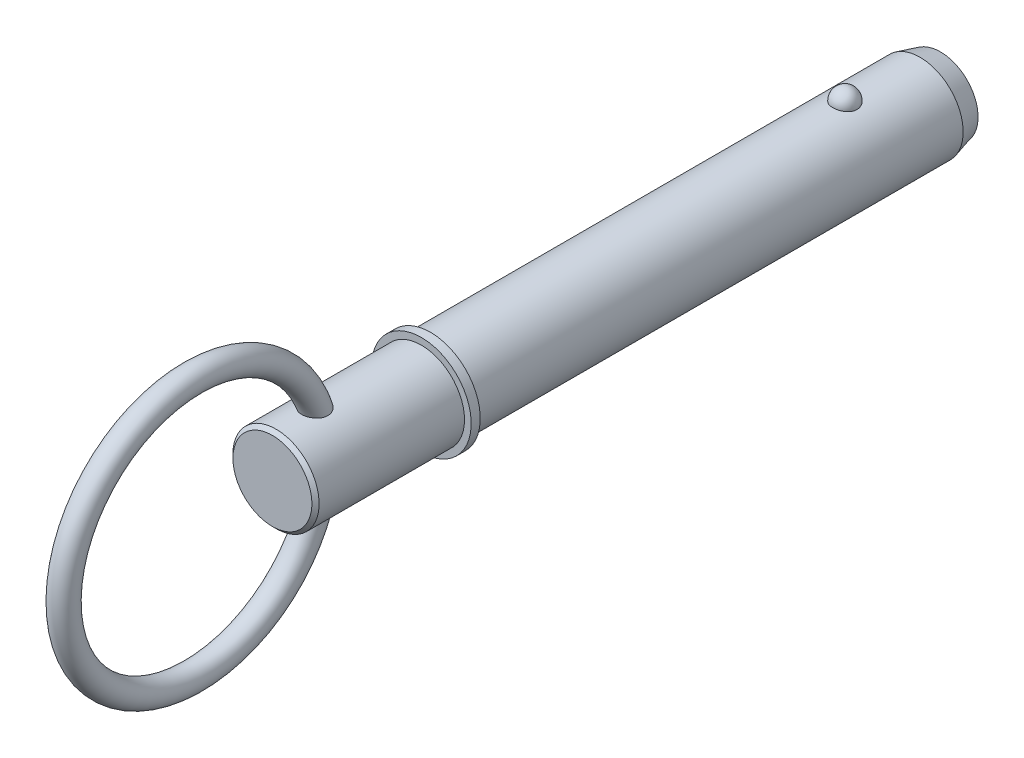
from build123d import *

# Parameters (mm, degrees)
SKETCH2_R           = 9.525
BOSS_EXTRUDE1_DEPTH = 88.9
BOSS_EXTRUDE2_START = 23.8
SKETCH3_R           = 9.525
BOSS_EXTRUDE2_DEPTH = 23.8
CHAMFER1_SIZE       = 4.5
CHAMFER1_SIZE2      = 1.205771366
SKETCH20_W          = 2
SKETCH20_H          = 11
SKETCH21_R          = 9.525
BOSS_EXTRUDE3_DEPTH = 34.93
CHAMFER2_SIZE       = 0.8
SKETCH24_R          = 2.75


with BuildPart() as part:
    # Sketch2 → Boss-Extrude1 (new body)
    with BuildSketch(Plane.XY):
        Circle(SKETCH2_R)
    extrude(amount=BOSS_EXTRUDE1_DEPTH)

    # Sketch3 → Boss-Extrude2 (add)
    with BuildSketch(Plane(origin=(0, 0, 0), x_dir=(-1, 0, 0), z_dir=(0, 0, -1)).offset(BOSS_EXTRUDE2_START)):
        Circle(SKETCH3_R)
    extrude(amount=-BOSS_EXTRUDE2_DEPTH)

    # Chamfer1
    chamfer1_edges = [part.edges().sort_by_distance(p)[0] for p in [
        (9.525, 0, -23.8),
    ]]
    chamfer1_side = [part.faces().sort_by_distance(p)[0] for p in [
        (9.525, 0, -11.9),
    ]]
    chamfer(chamfer1_edges, length=CHAMFER1_SIZE, length2=CHAMFER1_SIZE2, reference=chamfer1_side[0])

    # Sketch18 → Revolve1 (revolve)
    with BuildSketch(Plane(origin=(0, 0, 0), x_dir=(0, 0, -1), z_dir=(1, 0, 0))):
        with BuildLine():
            Line((2.69, 12.215), (2.69, 6.835))
            ThreePointArc((2.69, 6.835), (0, 9.525), (2.69, 12.215))
        make_face()
    revolve(axis=Axis((0, 12.215, -2.69), (0, -1, 0)))

    # Sketch20 → Revolve2 (revolve)
    with BuildSketch(Plane(origin=(0, 0, 0), x_dir=(0, 0, -1), z_dir=(1, 0, 0)), mode=Mode.PRIVATE) as revolve2_sk:
        with Locations((-89.9, 5.5)):
            Rectangle(SKETCH20_W, SKETCH20_H)
    revolve(revolve2_sk.sketch.rotate(Axis((0, 0, 33.728787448), (0, 0, 1)), 90), axis=Axis((0, 0, 33.728787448), (0, 0, 1)))

    # Sketch21 → Boss-Extrude3 (add)
    with BuildSketch(Plane(origin=(0, 0, 88.9), x_dir=(-1, 0, 0), z_dir=(0, 0, -1))):
        Circle(SKETCH21_R)
    extrude(amount=-BOSS_EXTRUDE3_DEPTH)

    # Chamfer2
    chamfer2_edges = [part.edges().sort_by_distance(p)[0] for p in [
        (9.525, 0, 123.83),
    ]]
    chamfer(chamfer2_edges, length=CHAMFER2_SIZE)

    # Sweep1: sweep along a path in Sketch23
    with BuildLine(Plane(origin=(0, 0, 0), x_dir=(0, 0, -1), z_dir=(1, 0, 0))) as sweep1_path:
        CenterArc((-141.405, 0), 28.575, 0, 360)
    # Sketch24 → Sweep1 (sweep)
    with BuildSketch(Plane(origin=(0, 0, 0), x_dir=(1, 0, 0), z_dir=(0, 1, 0))):
        with Locations((0, -112.83)):
            Circle(SKETCH24_R)
    sweep(path=sweep1_path.line)


solid = part.part
